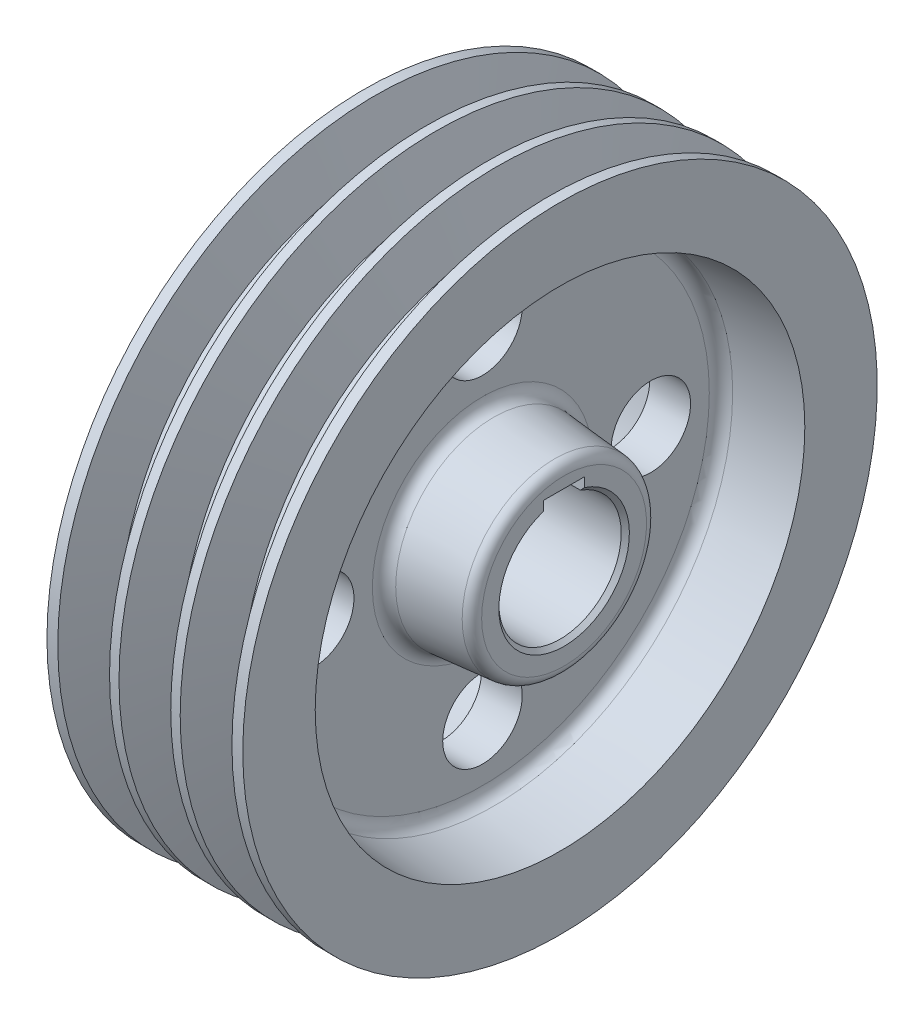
ISO-10303-21;
HEADER;
FILE_DESCRIPTION(('STEP AP214'),'2;1');
FILE_NAME('part.step','',(''),(''),'','','');
FILE_SCHEMA(('AUTOMOTIVE_DESIGN { 1 0 10303 214 1 1 1 1 }'));
ENDSEC;
DATA;
#1=APPLICATION_CONTEXT('core data for automotive mechanical design processes');
#2=APPLICATION_PROTOCOL_DEFINITION('international standard','automotive_design',2000,#1);
#3=PRODUCT_CONTEXT('',#1,'mechanical');
#4=PRODUCT('Part','Part','',(#3));
#5=PRODUCT_RELATED_PRODUCT_CATEGORY('part','',(#4));
#6=PRODUCT_DEFINITION_FORMATION('','',#4);
#7=PRODUCT_DEFINITION_CONTEXT('part definition',#1,'design');
#8=PRODUCT_DEFINITION('design','',#6,#7);
#9=PRODUCT_DEFINITION_SHAPE('','',#8);
#10=(LENGTH_UNIT() NAMED_UNIT(*) SI_UNIT(.MILLI.,.METRE.));
#11=(NAMED_UNIT(*) PLANE_ANGLE_UNIT() SI_UNIT($,.RADIAN.));
#12=(NAMED_UNIT(*) SI_UNIT($,.STERADIAN.) SOLID_ANGLE_UNIT());
#13=UNCERTAINTY_MEASURE_WITH_UNIT(LENGTH_MEASURE(1.E-05),#10,'distance_accuracy_value','');
#14=(GEOMETRIC_REPRESENTATION_CONTEXT(3) GLOBAL_UNCERTAINTY_ASSIGNED_CONTEXT((#13)) GLOBAL_UNIT_ASSIGNED_CONTEXT((#10,
#11,#12)) REPRESENTATION_CONTEXT('',''));
#15=CARTESIAN_POINT('',(0.,0.,0.));
#16=DIRECTION('',(0.,0.,1.));
#17=DIRECTION('',(1.,0.,0.));
#18=AXIS2_PLACEMENT_3D('',#15,#16,#17);
#19=CARTESIAN_POINT('',(19.,24.2497732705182,0.));
#20=DIRECTION('',(1.,0.,0.));
#21=DIRECTION('',(0.,0.,-1.));
#22=AXIS2_PLACEMENT_3D('',#19,#20,#21);
#23=PLANE('',#22);
#24=CARTESIAN_POINT('',(19.,-41.25,2.88047210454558E-13));
#25=DIRECTION('',(1.,0.,0.));
#26=DIRECTION('',(0.,0.,-1.));
#27=AXIS2_PLACEMENT_3D('',#24,#25,#26);
#28=CIRCLE('',#27,9.75000000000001);
#29=CARTESIAN_POINT('',(19.,-41.25,-9.74999999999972));
#30=VERTEX_POINT('',#29);
#31=EDGE_CURVE('E330',#30,#30,#28,.F.);
#32=ORIENTED_EDGE('',*,*,#31,.F.);
#33=EDGE_LOOP('',(#32));
#34=FACE_BOUND('',#33,.T.);
#35=CARTESIAN_POINT('',(19.,41.25,0.));
#36=DIRECTION('',(1.,0.,0.));
#37=DIRECTION('',(0.,0.,-1.));
#38=AXIS2_PLACEMENT_3D('',#35,#36,#37);
#39=CIRCLE('',#38,9.75000000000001);
#40=CARTESIAN_POINT('',(19.,41.25,-9.75000000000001));
#41=VERTEX_POINT('',#40);
#42=EDGE_CURVE('E116',#41,#41,#39,.F.);
#43=ORIENTED_EDGE('',*,*,#42,.F.);
#44=EDGE_LOOP('',(#43));
#45=FACE_BOUND('',#44,.T.);
#46=CARTESIAN_POINT('',(19.,0.,0.));
#47=DIRECTION('',(1.,0.,0.));
#48=DIRECTION('',(0.,0.,-1.));
#49=AXIS2_PLACEMENT_3D('',#46,#47,#48);
#50=CIRCLE('',#49,26.9987667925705);
#51=CARTESIAN_POINT('',(19.,0.,-26.9987667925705));
#52=VERTEX_POINT('',#51);
#53=EDGE_CURVE('E296',#52,#52,#50,.T.);
#54=ORIENTED_EDGE('',*,*,#53,.T.);
#55=EDGE_LOOP('',(#54));
#56=FACE_BOUND('',#55,.T.);
#57=CARTESIAN_POINT('',(19.,0.,0.));
#58=DIRECTION('',(1.,0.,0.));
#59=DIRECTION('',(0.,0.,-1.));
#60=AXIS2_PLACEMENT_3D('',#57,#58,#59);
#61=CIRCLE('',#60,55.5887218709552);
#62=CARTESIAN_POINT('',(19.,0.,-55.5887218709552));
#63=VERTEX_POINT('',#62);
#64=EDGE_CURVE('E292',#63,#63,#61,.F.);
#65=ORIENTED_EDGE('',*,*,#64,.T.);
#66=EDGE_LOOP('',(#65));
#67=FACE_BOUND('',#66,.T.);
#68=CARTESIAN_POINT('',(19.,-1.44023605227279E-13,-41.25));
#69=DIRECTION('',(1.,0.,0.));
#70=DIRECTION('',(0.,0.,-1.));
#71=AXIS2_PLACEMENT_3D('',#68,#69,#70);
#72=CIRCLE('',#71,9.75000000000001);
#73=CARTESIAN_POINT('',(19.,-1.44023605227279E-13,-51.));
#74=VERTEX_POINT('',#73);
#75=EDGE_CURVE('E327',#74,#74,#72,.F.);
#76=ORIENTED_EDGE('',*,*,#75,.F.);
#77=EDGE_LOOP('',(#76));
#78=FACE_BOUND('',#77,.T.);
#79=CARTESIAN_POINT('',(19.,4.32070815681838E-13,41.25));
#80=DIRECTION('',(1.,0.,0.));
#81=DIRECTION('',(0.,0.,-1.));
#82=AXIS2_PLACEMENT_3D('',#79,#80,#81);
#83=CIRCLE('',#82,9.75000000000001);
#84=CARTESIAN_POINT('',(19.,4.32070815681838E-13,31.5));
#85=VERTEX_POINT('',#84);
#86=EDGE_CURVE('E333',#85,#85,#83,.F.);
#87=ORIENTED_EDGE('',*,*,#86,.F.);
#88=EDGE_LOOP('',(#87));
#89=FACE_BOUND('',#88,.T.);
#90=ADVANCED_FACE('F33',(#34,#45,#56,#67,#78,#89),#23,.F.);
#91=CARTESIAN_POINT('',(29.,58.3377153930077,0.));
#92=DIRECTION('',(-1.,0.,0.));
#93=DIRECTION('',(0.,0.,1.));
#94=AXIS2_PLACEMENT_3D('',#91,#92,#93);
#95=PLANE('',#94);
#96=CARTESIAN_POINT('',(29.,-41.25,2.88047210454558E-13));
#97=DIRECTION('',(-1.,0.,0.));
#98=DIRECTION('',(0.,0.,1.));
#99=AXIS2_PLACEMENT_3D('',#96,#97,#98);
#100=CIRCLE('',#99,9.75000000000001);
#101=CARTESIAN_POINT('',(29.,-41.25,9.75000000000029));
#102=VERTEX_POINT('',#101);
#103=EDGE_CURVE('E331',#102,#102,#100,.F.);
#104=ORIENTED_EDGE('',*,*,#103,.F.);
#105=EDGE_LOOP('',(#104));
#106=FACE_BOUND('',#105,.T.);
#107=CARTESIAN_POINT('',(29.,41.25,0.));
#108=DIRECTION('',(-1.,0.,0.));
#109=DIRECTION('',(0.,0.,1.));
#110=AXIS2_PLACEMENT_3D('',#107,#108,#109);
#111=CIRCLE('',#110,9.75000000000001);
#112=CARTESIAN_POINT('',(29.,41.25,9.75000000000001));
#113=VERTEX_POINT('',#112);
#114=EDGE_CURVE('E324',#113,#113,#111,.F.);
#115=ORIENTED_EDGE('',*,*,#114,.F.);
#116=EDGE_LOOP('',(#115));
#117=FACE_BOUND('',#116,.T.);
#118=CARTESIAN_POINT('',(29.,0.,0.));
#119=DIRECTION('',(-1.,0.,0.));
#120=DIRECTION('',(0.,0.,1.));
#121=AXIS2_PLACEMENT_3D('',#118,#119,#120);
#122=CIRCLE('',#121,26.9987667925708);
#123=CARTESIAN_POINT('',(29.,0.,26.9987667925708));
#124=VERTEX_POINT('',#123);
#125=EDGE_CURVE('E307',#124,#124,#122,.T.);
#126=ORIENTED_EDGE('',*,*,#125,.T.);
#127=EDGE_LOOP('',(#126));
#128=FACE_BOUND('',#127,.T.);
#129=CARTESIAN_POINT('',(29.,0.,0.));
#130=DIRECTION('',(-1.,0.,0.));
#131=DIRECTION('',(0.,0.,1.));
#132=AXIS2_PLACEMENT_3D('',#129,#130,#131);
#133=CIRCLE('',#132,55.5887218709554);
#134=CARTESIAN_POINT('',(29.,0.,55.5887218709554));
#135=VERTEX_POINT('',#134);
#136=EDGE_CURVE('E304',#135,#135,#133,.F.);
#137=ORIENTED_EDGE('',*,*,#136,.T.);
#138=EDGE_LOOP('',(#137));
#139=FACE_BOUND('',#138,.T.);
#140=CARTESIAN_POINT('',(29.,-1.44023605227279E-13,-41.25));
#141=DIRECTION('',(-1.,0.,0.));
#142=DIRECTION('',(0.,0.,1.));
#143=AXIS2_PLACEMENT_3D('',#140,#141,#142);
#144=CIRCLE('',#143,9.75000000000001);
#145=CARTESIAN_POINT('',(29.,-1.44023605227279E-13,-31.5));
#146=VERTEX_POINT('',#145);
#147=EDGE_CURVE('E328',#146,#146,#144,.F.);
#148=ORIENTED_EDGE('',*,*,#147,.F.);
#149=EDGE_LOOP('',(#148));
#150=FACE_BOUND('',#149,.T.);
#151=CARTESIAN_POINT('',(29.,4.32070815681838E-13,41.25));
#152=DIRECTION('',(-1.,0.,0.));
#153=DIRECTION('',(0.,0.,1.));
#154=AXIS2_PLACEMENT_3D('',#151,#152,#153);
#155=CIRCLE('',#154,9.75000000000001);
#156=CARTESIAN_POINT('',(29.,4.32070815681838E-13,51.));
#157=VERTEX_POINT('',#156);
#158=EDGE_CURVE('E37',#157,#157,#155,.F.);
#159=ORIENTED_EDGE('',*,*,#158,.F.);
#160=EDGE_LOOP('',(#159));
#161=FACE_BOUND('',#160,.T.);
#162=ADVANCED_FACE('F193',(#106,#117,#128,#139,#150,#161),#95,.F.);
#163=CARTESIAN_POINT('',(0.,0.,0.));
#164=DIRECTION('',(-1.,0.,0.));
#165=DIRECTION('',(0.,0.,1.));
#166=AXIS2_PLACEMENT_3D('',#163,#164,#165);
#167=CYLINDRICAL_SURFACE('',#166,77.75);
#168=CARTESIAN_POINT('',(48.,0.,0.));
#169=DIRECTION('',(-1.,0.,0.));
#170=DIRECTION('',(0.,0.,1.));
#171=AXIS2_PLACEMENT_3D('',#168,#169,#170);
#172=CIRCLE('',#171,77.75);
#173=CARTESIAN_POINT('',(48.,0.,77.75));
#174=VERTEX_POINT('',#173);
#175=EDGE_CURVE('E245',#174,#174,#172,.T.);
#176=ORIENTED_EDGE('',*,*,#175,.T.);
#177=EDGE_LOOP('',(#176));
#178=FACE_BOUND('',#177,.T.);
#179=CARTESIAN_POINT('',(45.3407593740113,0.,0.));
#180=DIRECTION('',(-1.,0.,0.));
#181=DIRECTION('',(0.,0.,1.));
#182=AXIS2_PLACEMENT_3D('',#179,#180,#181);
#183=CIRCLE('',#182,77.75);
#184=CARTESIAN_POINT('',(45.3407593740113,0.,77.75));
#185=VERTEX_POINT('',#184);
#186=EDGE_CURVE('E278',#185,#185,#183,.T.);
#187=ORIENTED_EDGE('',*,*,#186,.F.);
#188=EDGE_LOOP('',(#187));
#189=FACE_BOUND('',#188,.T.);
#190=ADVANCED_FACE('F199',(#178,#189),#167,.T.);
#191=CARTESIAN_POINT('',(30.3407593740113,0.,0.));
#192=DIRECTION('',(-1.,0.,0.));
#193=DIRECTION('',(0.,0.,1.));
#194=AXIS2_PLACEMENT_3D('',#191,#192,#193);
#195=CIRCLE('',#194,77.75);
#196=CARTESIAN_POINT('',(30.3407593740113,0.,77.75));
#197=VERTEX_POINT('',#196);
#198=EDGE_CURVE('E266',#197,#197,#195,.T.);
#199=ORIENTED_EDGE('',*,*,#198,.F.);
#200=EDGE_LOOP('',(#199));
#201=FACE_BOUND('',#200,.T.);
#202=CARTESIAN_POINT('',(32.6592406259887,0.,0.));
#203=DIRECTION('',(-1.,0.,0.));
#204=DIRECTION('',(0.,0.,1.));
#205=AXIS2_PLACEMENT_3D('',#202,#203,#204);
#206=CIRCLE('',#205,77.75);
#207=CARTESIAN_POINT('',(32.6592406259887,0.,77.75));
#208=VERTEX_POINT('',#207);
#209=EDGE_CURVE('E281',#208,#208,#206,.T.);
#210=ORIENTED_EDGE('',*,*,#209,.T.);
#211=EDGE_LOOP('',(#210));
#212=FACE_BOUND('',#211,.T.);
#213=ADVANCED_FACE('F604',(#201,#212),#167,.T.);
#214=CARTESIAN_POINT('',(15.3407593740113,0.,0.));
#215=DIRECTION('',(-1.,0.,0.));
#216=DIRECTION('',(0.,0.,1.));
#217=AXIS2_PLACEMENT_3D('',#214,#215,#216);
#218=CIRCLE('',#217,77.75);
#219=CARTESIAN_POINT('',(15.3407593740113,0.,77.75));
#220=VERTEX_POINT('',#219);
#221=EDGE_CURVE('E254',#220,#220,#218,.T.);
#222=ORIENTED_EDGE('',*,*,#221,.F.);
#223=EDGE_LOOP('',(#222));
#224=FACE_BOUND('',#223,.T.);
#225=CARTESIAN_POINT('',(17.6592406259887,0.,0.));
#226=DIRECTION('',(-1.,0.,0.));
#227=DIRECTION('',(0.,0.,1.));
#228=AXIS2_PLACEMENT_3D('',#225,#226,#227);
#229=CIRCLE('',#228,77.75);
#230=CARTESIAN_POINT('',(17.6592406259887,0.,77.75));
#231=VERTEX_POINT('',#230);
#232=EDGE_CURVE('E269',#231,#231,#229,.T.);
#233=ORIENTED_EDGE('',*,*,#232,.T.);
#234=EDGE_LOOP('',(#233));
#235=FACE_BOUND('',#234,.T.);
#236=ADVANCED_FACE('F222',(#224,#235),#167,.T.);
#237=CARTESIAN_POINT('',(0.,0.,0.));
#238=DIRECTION('',(-1.,0.,0.));
#239=DIRECTION('',(0.,0.,1.));
#240=AXIS2_PLACEMENT_3D('',#237,#238,#239);
#241=CIRCLE('',#240,77.75);
#242=CARTESIAN_POINT('',(0.,0.,77.75));
#243=VERTEX_POINT('',#242);
#244=EDGE_CURVE('E242',#243,#243,#241,.T.);
#245=ORIENTED_EDGE('',*,*,#244,.F.);
#246=EDGE_LOOP('',(#245));
#247=FACE_BOUND('',#246,.T.);
#248=CARTESIAN_POINT('',(2.65924062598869,0.,0.));
#249=DIRECTION('',(-1.,0.,0.));
#250=DIRECTION('',(0.,0.,1.));
#251=AXIS2_PLACEMENT_3D('',#248,#249,#250);
#252=CIRCLE('',#251,77.75);
#253=CARTESIAN_POINT('',(2.65924062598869,0.,77.75));
#254=VERTEX_POINT('',#253);
#255=EDGE_CURVE('E257',#254,#254,#252,.T.);
#256=ORIENTED_EDGE('',*,*,#255,.T.);
#257=EDGE_LOOP('',(#256));
#258=FACE_BOUND('',#257,.T.);
#259=ADVANCED_FACE('F217',(#247,#258),#167,.T.);
#260=CARTESIAN_POINT('',(0.,0.,0.));
#261=DIRECTION('',(-1.,0.,0.));
#262=DIRECTION('',(0.,0.,1.));
#263=AXIS2_PLACEMENT_3D('',#260,#261,#262);
#264=CYLINDRICAL_SURFACE('',#263,15.);
#265=CARTESIAN_POINT('',(0.,0.,0.));
#266=DIRECTION('',(1.,0.,0.));
#267=DIRECTION('',(0.,0.,-1.));
#268=AXIS2_PLACEMENT_3D('',#265,#266,#267);
#269=CIRCLE('',#268,15.);
#270=CARTESIAN_POINT('',(0.,14.1421356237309,-5.));
#271=VERTEX_POINT('',#270);
#272=CARTESIAN_POINT('',(0.,14.1421356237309,5.));
#273=VERTEX_POINT('',#272);
#274=EDGE_CURVE('E228',#271,#273,#269,.F.);
#275=ORIENTED_EDGE('',*,*,#274,.T.);
#276=DIRECTION('',(-1.,0.,0.));
#277=VECTOR('',#276,1.);
#278=CARTESIAN_POINT('',(49.,14.1421356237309,5.));
#279=LINE('',#278,#277);
#280=CARTESIAN_POINT('',(48.,14.1421356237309,5.));
#281=VERTEX_POINT('',#280);
#282=EDGE_CURVE('E95',#281,#273,#279,.T.);
#283=ORIENTED_EDGE('',*,*,#282,.F.);
#284=CARTESIAN_POINT('',(48.,0.,0.));
#285=DIRECTION('',(-1.,0.,0.));
#286=DIRECTION('',(0.,0.,1.));
#287=AXIS2_PLACEMENT_3D('',#284,#285,#286);
#288=CIRCLE('',#287,15.);
#289=CARTESIAN_POINT('',(48.,14.1421356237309,-5.));
#290=VERTEX_POINT('',#289);
#291=EDGE_CURVE('E234',#281,#290,#288,.F.);
#292=ORIENTED_EDGE('',*,*,#291,.T.);
#293=DIRECTION('',(-1.,0.,0.));
#294=VECTOR('',#293,1.);
#295=CARTESIAN_POINT('',(49.,14.1421356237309,-5.));
#296=LINE('',#295,#294);
#297=EDGE_CURVE('E103',#290,#271,#296,.T.);
#298=ORIENTED_EDGE('',*,*,#297,.T.);
#299=EDGE_LOOP('',(#275,#283,#292,#298));
#300=FACE_BOUND('',#299,.T.);
#301=ADVANCED_FACE('F214',(#300),#264,.F.);
#302=CARTESIAN_POINT('',(-1.,15.,0.));
#303=DIRECTION('',(1.,0.,0.));
#304=DIRECTION('',(0.,0.,-1.));
#305=AXIS2_PLACEMENT_3D('',#302,#303,#304);
#306=PLANE('',#305);
#307=CARTESIAN_POINT('',(-1.,0.,0.));
#308=DIRECTION('',(1.,0.,0.));
#309=DIRECTION('',(0.,0.,-1.));
#310=AXIS2_PLACEMENT_3D('',#307,#308,#309);
#311=CIRCLE('',#310,20.2091720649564);
#312=CARTESIAN_POINT('',(-1.,0.,-20.2091720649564));
#313=VERTEX_POINT('',#312);
#314=EDGE_CURVE('E42',#313,#313,#311,.F.);
#315=ORIENTED_EDGE('',*,*,#314,.T.);
#316=EDGE_LOOP('',(#315));
#317=FACE_BOUND('',#316,.T.);
#318=CARTESIAN_POINT('',(-1.,0.,0.));
#319=DIRECTION('',(1.,0.,0.));
#320=DIRECTION('',(0.,0.,-1.));
#321=AXIS2_PLACEMENT_3D('',#318,#319,#320);
#322=CIRCLE('',#321,16.);
#323=CARTESIAN_POINT('',(-1.,15.1986841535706,5.));
#324=VERTEX_POINT('',#323);
#325=CARTESIAN_POINT('',(-1.,15.1986841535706,-5.));
#326=VERTEX_POINT('',#325);
#327=EDGE_CURVE('E233',#324,#326,#322,.T.);
#328=ORIENTED_EDGE('',*,*,#327,.T.);
#329=DIRECTION('',(0.,-1.,0.));
#330=VECTOR('',#329,1.);
#331=CARTESIAN_POINT('',(-1.,14.1421356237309,-5.));
#332=LINE('',#331,#330);
#333=CARTESIAN_POINT('',(-1.,17.5,-5.));
#334=VERTEX_POINT('',#333);
#335=EDGE_CURVE('E58',#334,#326,#332,.T.);
#336=ORIENTED_EDGE('',*,*,#335,.F.);
#337=DIRECTION('',(0.,0.,-1.));
#338=VECTOR('',#337,1.);
#339=CARTESIAN_POINT('',(-1.,17.5,-5.));
#340=LINE('',#339,#338);
#341=CARTESIAN_POINT('',(-1.,17.5,5.));
#342=VERTEX_POINT('',#341);
#343=EDGE_CURVE('E111',#342,#334,#340,.T.);
#344=ORIENTED_EDGE('',*,*,#343,.F.);
#345=DIRECTION('',(0.,1.,0.));
#346=VECTOR('',#345,1.);
#347=CARTESIAN_POINT('',(-1.,14.1421356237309,5.));
#348=LINE('',#347,#346);
#349=EDGE_CURVE('E90',#324,#342,#348,.T.);
#350=ORIENTED_EDGE('',*,*,#349,.F.);
#351=EDGE_LOOP('',(#328,#336,#344,#350));
#352=FACE_BOUND('',#351,.T.);
#353=ADVANCED_FACE('F211',(#317,#352),#306,.F.);
#354=CARTESIAN_POINT('',(19.,0.,0.));
#355=DIRECTION('',(1.,0.,0.));
#356=DIRECTION('',(0.,0.,-1.));
#357=AXIS2_PLACEMENT_3D('',#354,#355,#356);
#358=CONICAL_SURFACE('',#357,24.2497732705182,0.0872664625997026);
#359=CARTESIAN_POINT('',(1.28211064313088,0.,0.));
#360=DIRECTION('',(-1.,0.,0.));
#361=DIRECTION('',(0.,0.,1.));
#362=AXIS2_PLACEMENT_3D('',#359,#360,#361);
#363=CIRCLE('',#362,22.6996588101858);
#364=CARTESIAN_POINT('',(1.28211064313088,0.,22.6996588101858));
#365=VERTEX_POINT('',#364);
#366=EDGE_CURVE('E11',#365,#365,#363,.F.);
#367=ORIENTED_EDGE('',*,*,#366,.T.);
#368=EDGE_LOOP('',(#367));
#369=FACE_BOUND('',#368,.T.);
#370=CARTESIAN_POINT('',(16.2614672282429,0.,0.));
#371=DIRECTION('',(1.,0.,0.));
#372=DIRECTION('',(0.,0.,-1.));
#373=AXIS2_PLACEMENT_3D('',#370,#371,#372);
#374=CIRCLE('',#373,24.0101826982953);
#375=CARTESIAN_POINT('',(16.2614672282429,0.,-24.0101826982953));
#376=VERTEX_POINT('',#375);
#377=EDGE_CURVE('E290',#376,#376,#374,.F.);
#378=ORIENTED_EDGE('',*,*,#377,.T.);
#379=EDGE_LOOP('',(#378));
#380=FACE_BOUND('',#379,.T.);
#381=ADVANCED_FACE('F208',(#369,#380),#358,.T.);
#382=CARTESIAN_POINT('',(0.,0.,0.));
#383=DIRECTION('',(-1.,0.,0.));
#384=DIRECTION('',(0.,0.,1.));
#385=AXIS2_PLACEMENT_3D('',#382,#383,#384);
#386=CONICAL_SURFACE('',#385,60.,0.0872664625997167);
#387=CARTESIAN_POINT('',(16.261467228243,0.,0.));
#388=DIRECTION('',(-1.,0.,0.));
#389=DIRECTION('',(0.,0.,1.));
#390=AXIS2_PLACEMENT_3D('',#387,#388,#389);
#391=CIRCLE('',#390,58.5773059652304);
#392=CARTESIAN_POINT('',(16.261467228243,0.,58.5773059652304));
#393=VERTEX_POINT('',#392);
#394=EDGE_CURVE('E301',#393,#393,#391,.F.);
#395=ORIENTED_EDGE('',*,*,#394,.T.);
#396=EDGE_LOOP('',(#395));
#397=FACE_BOUND('',#396,.T.);
#398=CARTESIAN_POINT('',(0.,0.,0.));
#399=DIRECTION('',(-1.,0.,0.));
#400=DIRECTION('',(0.,0.,1.));
#401=AXIS2_PLACEMENT_3D('',#398,#399,#400);
#402=CIRCLE('',#401,60.);
#403=CARTESIAN_POINT('',(0.,0.,60.));
#404=VERTEX_POINT('',#403);
#405=EDGE_CURVE('E237',#404,#404,#402,.T.);
#406=ORIENTED_EDGE('',*,*,#405,.T.);
#407=EDGE_LOOP('',(#406));
#408=FACE_BOUND('',#407,.T.);
#409=ADVANCED_FACE('F206',(#397,#408),#386,.F.);
#410=CARTESIAN_POINT('',(0.,60.,0.));
#411=DIRECTION('',(1.,0.,0.));
#412=DIRECTION('',(0.,0.,-1.));
#413=AXIS2_PLACEMENT_3D('',#410,#411,#412);
#414=PLANE('',#413);
#415=ORIENTED_EDGE('',*,*,#405,.F.);
#416=EDGE_LOOP('',(#415));
#417=FACE_BOUND('',#416,.T.);
#418=ORIENTED_EDGE('',*,*,#244,.T.);
#419=EDGE_LOOP('',(#418));
#420=FACE_BOUND('',#419,.T.);
#421=ADVANCED_FACE('F495',(#417,#420),#414,.F.);
#422=CARTESIAN_POINT('',(48.,77.75,0.));
#423=DIRECTION('',(-1.,0.,0.));
#424=DIRECTION('',(0.,0.,1.));
#425=AXIS2_PLACEMENT_3D('',#422,#423,#424);
#426=PLANE('',#425);
#427=ORIENTED_EDGE('',*,*,#175,.F.);
#428=EDGE_LOOP('',(#427));
#429=FACE_BOUND('',#428,.T.);
#430=CARTESIAN_POINT('',(48.,0.,0.));
#431=DIRECTION('',(-1.,0.,0.));
#432=DIRECTION('',(0.,0.,1.));
#433=AXIS2_PLACEMENT_3D('',#430,#431,#432);
#434=CIRCLE('',#433,60.);
#435=CARTESIAN_POINT('',(48.,0.,60.));
#436=VERTEX_POINT('',#435);
#437=EDGE_CURVE('E248',#436,#436,#434,.T.);
#438=ORIENTED_EDGE('',*,*,#437,.T.);
#439=EDGE_LOOP('',(#438));
#440=FACE_BOUND('',#439,.T.);
#441=ADVANCED_FACE('F485',(#429,#440),#426,.F.);
#442=CARTESIAN_POINT('',(29.,0.,0.));
#443=DIRECTION('',(1.,0.,0.));
#444=DIRECTION('',(0.,0.,-1.));
#445=AXIS2_PLACEMENT_3D('',#442,#443,#444);
#446=CONICAL_SURFACE('',#445,58.3377153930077,0.0872664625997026);
#447=CARTESIAN_POINT('',(31.7385327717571,0.,0.));
#448=DIRECTION('',(1.,0.,0.));
#449=DIRECTION('',(0.,0.,-1.));
#450=AXIS2_PLACEMENT_3D('',#447,#448,#449);
#451=CIRCLE('',#450,58.5773059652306);
#452=CARTESIAN_POINT('',(31.7385327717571,0.,-58.5773059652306));
#453=VERTEX_POINT('',#452);
#454=EDGE_CURVE('E313',#453,#453,#451,.F.);
#455=ORIENTED_EDGE('',*,*,#454,.T.);
#456=EDGE_LOOP('',(#455));
#457=FACE_BOUND('',#456,.T.);
#458=ORIENTED_EDGE('',*,*,#437,.F.);
#459=EDGE_LOOP('',(#458));
#460=FACE_BOUND('',#459,.T.);
#461=ADVANCED_FACE('F436',(#457,#460),#446,.F.);
#462=CARTESIAN_POINT('',(49.,0.,0.));
#463=DIRECTION('',(-1.,0.,0.));
#464=DIRECTION('',(0.,0.,1.));
#465=AXIS2_PLACEMENT_3D('',#462,#463,#464);
#466=CONICAL_SURFACE('',#465,22.5,0.0872664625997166);
#467=CARTESIAN_POINT('',(46.7178893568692,0.,0.));
#468=DIRECTION('',(1.,0.,0.));
#469=DIRECTION('',(0.,0.,-1.));
#470=AXIS2_PLACEMENT_3D('',#467,#468,#469);
#471=CIRCLE('',#470,22.6996588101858);
#472=CARTESIAN_POINT('',(46.7178893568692,0.,-22.6996588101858));
#473=VERTEX_POINT('',#472);
#474=EDGE_CURVE('E316',#473,#473,#471,.F.);
#475=ORIENTED_EDGE('',*,*,#474,.T.);
#476=EDGE_LOOP('',(#475));
#477=FACE_BOUND('',#476,.T.);
#478=CARTESIAN_POINT('',(31.738532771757,0.,0.));
#479=DIRECTION('',(-1.,0.,0.));
#480=DIRECTION('',(0.,0.,1.));
#481=AXIS2_PLACEMENT_3D('',#478,#479,#480);
#482=CIRCLE('',#481,24.0101826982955);
#483=CARTESIAN_POINT('',(31.738532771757,0.,24.0101826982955));
#484=VERTEX_POINT('',#483);
#485=EDGE_CURVE('E310',#484,#484,#482,.F.);
#486=ORIENTED_EDGE('',*,*,#485,.T.);
#487=EDGE_LOOP('',(#486));
#488=FACE_BOUND('',#487,.T.);
#489=ADVANCED_FACE('F424',(#477,#488),#466,.T.);
#490=CARTESIAN_POINT('',(49.,22.5,0.));
#491=DIRECTION('',(-1.,0.,0.));
#492=DIRECTION('',(0.,0.,1.));
#493=AXIS2_PLACEMENT_3D('',#490,#491,#492);
#494=PLANE('',#493);
#495=CARTESIAN_POINT('',(49.,0.,0.));
#496=DIRECTION('',(-1.,0.,0.));
#497=DIRECTION('',(0.,0.,1.));
#498=AXIS2_PLACEMENT_3D('',#495,#496,#497);
#499=CIRCLE('',#498,20.2091720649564);
#500=CARTESIAN_POINT('',(49.,0.,20.2091720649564));
#501=VERTEX_POINT('',#500);
#502=EDGE_CURVE('E319',#501,#501,#499,.F.);
#503=ORIENTED_EDGE('',*,*,#502,.T.);
#504=EDGE_LOOP('',(#503));
#505=FACE_BOUND('',#504,.T.);
#506=DIRECTION('',(0.,0.,-1.));
#507=VECTOR('',#506,1.);
#508=CARTESIAN_POINT('',(49.,17.5,-5.));
#509=LINE('',#508,#507);
#510=CARTESIAN_POINT('',(49.,17.5,5.));
#511=VERTEX_POINT('',#510);
#512=CARTESIAN_POINT('',(49.,17.5,-5.));
#513=VERTEX_POINT('',#512);
#514=EDGE_CURVE('E98',#511,#513,#509,.T.);
#515=ORIENTED_EDGE('',*,*,#514,.T.);
#516=DIRECTION('',(0.,-1.,0.));
#517=VECTOR('',#516,1.);
#518=CARTESIAN_POINT('',(49.,14.1421356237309,-5.));
#519=LINE('',#518,#517);
#520=CARTESIAN_POINT('',(49.,15.1986841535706,-5.));
#521=VERTEX_POINT('',#520);
#522=EDGE_CURVE('E109',#513,#521,#519,.T.);
#523=ORIENTED_EDGE('',*,*,#522,.T.);
#524=CARTESIAN_POINT('',(49.,0.,0.));
#525=DIRECTION('',(-1.,0.,0.));
#526=DIRECTION('',(0.,0.,1.));
#527=AXIS2_PLACEMENT_3D('',#524,#525,#526);
#528=CIRCLE('',#527,16.);
#529=CARTESIAN_POINT('',(49.,15.1986841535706,5.));
#530=VERTEX_POINT('',#529);
#531=EDGE_CURVE('E108',#521,#530,#528,.T.);
#532=ORIENTED_EDGE('',*,*,#531,.T.);
#533=DIRECTION('',(0.,1.,0.));
#534=VECTOR('',#533,1.);
#535=CARTESIAN_POINT('',(49.,14.1421356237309,5.));
#536=LINE('',#535,#534);
#537=EDGE_CURVE('E50',#530,#511,#536,.T.);
#538=ORIENTED_EDGE('',*,*,#537,.T.);
#539=EDGE_LOOP('',(#515,#523,#532,#538));
#540=FACE_BOUND('',#539,.T.);
#541=ADVANCED_FACE('F106',(#505,#540),#494,.F.);
#542=CARTESIAN_POINT('',(0.,0.,0.));
#543=DIRECTION('',(-1.,0.,0.));
#544=DIRECTION('',(0.,0.,1.));
#545=AXIS2_PLACEMENT_3D('',#542,#543,#544);
#546=CYLINDRICAL_SURFACE('',#545,66.3);
#547=CARTESIAN_POINT('',(11.8401430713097,0.,0.));
#548=DIRECTION('',(-1.,0.,0.));
#549=DIRECTION('',(0.,0.,1.));
#550=AXIS2_PLACEMENT_3D('',#547,#548,#549);
#551=CIRCLE('',#550,66.3);
#552=CARTESIAN_POINT('',(11.8401430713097,0.,66.3));
#553=VERTEX_POINT('',#552);
#554=EDGE_CURVE('E251',#553,#553,#551,.T.);
#555=ORIENTED_EDGE('',*,*,#554,.T.);
#556=EDGE_LOOP('',(#555));
#557=FACE_BOUND('',#556,.T.);
#558=CARTESIAN_POINT('',(6.15985692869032,0.,0.));
#559=DIRECTION('',(-1.,0.,0.));
#560=DIRECTION('',(0.,0.,1.));
#561=AXIS2_PLACEMENT_3D('',#558,#559,#560);
#562=CIRCLE('',#561,66.3);
#563=CARTESIAN_POINT('',(6.15985692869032,0.,66.3));
#564=VERTEX_POINT('',#563);
#565=EDGE_CURVE('E260',#564,#564,#562,.T.);
#566=ORIENTED_EDGE('',*,*,#565,.F.);
#567=EDGE_LOOP('',(#566));
#568=FACE_BOUND('',#567,.T.);
#569=ADVANCED_FACE('F423',(#557,#568),#546,.T.);
#570=CARTESIAN_POINT('',(11.8401430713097,0.,0.));
#571=DIRECTION('',(1.,0.,0.));
#572=DIRECTION('',(0.,0.,-1.));
#573=AXIS2_PLACEMENT_3D('',#570,#571,#572);
#574=CONICAL_SURFACE('',#573,66.3,1.27409035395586);
#575=ORIENTED_EDGE('',*,*,#221,.T.);
#576=EDGE_LOOP('',(#575));
#577=FACE_BOUND('',#576,.T.);
#578=ORIENTED_EDGE('',*,*,#554,.F.);
#579=EDGE_LOOP('',(#578));
#580=FACE_BOUND('',#579,.T.);
#581=ADVANCED_FACE('F626',(#577,#580),#574,.T.);
#582=CARTESIAN_POINT('',(2.65924062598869,0.,0.));
#583=DIRECTION('',(-1.,0.,0.));
#584=DIRECTION('',(0.,0.,1.));
#585=AXIS2_PLACEMENT_3D('',#582,#583,#584);
#586=CONICAL_SURFACE('',#585,77.75,1.27409035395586);
#587=ORIENTED_EDGE('',*,*,#565,.T.);
#588=EDGE_LOOP('',(#587));
#589=FACE_BOUND('',#588,.T.);
#590=ORIENTED_EDGE('',*,*,#255,.F.);
#591=EDGE_LOOP('',(#590));
#592=FACE_BOUND('',#591,.T.);
#593=ADVANCED_FACE('F592',(#589,#592),#586,.T.);
#594=CARTESIAN_POINT('',(15.,0.,0.));
#595=DIRECTION('',(-1.,0.,0.));
#596=DIRECTION('',(0.,0.,1.));
#597=AXIS2_PLACEMENT_3D('',#594,#595,#596);
#598=CYLINDRICAL_SURFACE('',#597,66.3);
#599=CARTESIAN_POINT('',(26.8401430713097,0.,0.));
#600=DIRECTION('',(-1.,0.,0.));
#601=DIRECTION('',(0.,0.,1.));
#602=AXIS2_PLACEMENT_3D('',#599,#600,#601);
#603=CIRCLE('',#602,66.3);
#604=CARTESIAN_POINT('',(26.8401430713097,0.,66.3));
#605=VERTEX_POINT('',#604);
#606=EDGE_CURVE('E263',#605,#605,#603,.T.);
#607=ORIENTED_EDGE('',*,*,#606,.T.);
#608=EDGE_LOOP('',(#607));
#609=FACE_BOUND('',#608,.T.);
#610=CARTESIAN_POINT('',(21.1598569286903,0.,0.));
#611=DIRECTION('',(-1.,0.,0.));
#612=DIRECTION('',(0.,0.,1.));
#613=AXIS2_PLACEMENT_3D('',#610,#611,#612);
#614=CIRCLE('',#613,66.3);
#615=CARTESIAN_POINT('',(21.1598569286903,0.,66.3));
#616=VERTEX_POINT('',#615);
#617=EDGE_CURVE('E272',#616,#616,#614,.T.);
#618=ORIENTED_EDGE('',*,*,#617,.F.);
#619=EDGE_LOOP('',(#618));
#620=FACE_BOUND('',#619,.T.);
#621=ADVANCED_FACE('F582',(#609,#620),#598,.T.);
#622=CARTESIAN_POINT('',(26.8401430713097,0.,0.));
#623=DIRECTION('',(1.,0.,0.));
#624=DIRECTION('',(0.,0.,-1.));
#625=AXIS2_PLACEMENT_3D('',#622,#623,#624);
#626=CONICAL_SURFACE('',#625,66.3,1.27409035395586);
#627=ORIENTED_EDGE('',*,*,#198,.T.);
#628=EDGE_LOOP('',(#627));
#629=FACE_BOUND('',#628,.T.);
#630=ORIENTED_EDGE('',*,*,#606,.F.);
#631=EDGE_LOOP('',(#630));
#632=FACE_BOUND('',#631,.T.);
#633=ADVANCED_FACE('F572',(#629,#632),#626,.T.);
#634=CARTESIAN_POINT('',(17.6592406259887,0.,0.));
#635=DIRECTION('',(-1.,0.,0.));
#636=DIRECTION('',(0.,0.,1.));
#637=AXIS2_PLACEMENT_3D('',#634,#635,#636);
#638=CONICAL_SURFACE('',#637,77.75,1.27409035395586);
#639=ORIENTED_EDGE('',*,*,#617,.T.);
#640=EDGE_LOOP('',(#639));
#641=FACE_BOUND('',#640,.T.);
#642=ORIENTED_EDGE('',*,*,#232,.F.);
#643=EDGE_LOOP('',(#642));
#644=FACE_BOUND('',#643,.T.);
#645=ADVANCED_FACE('F562',(#641,#644),#638,.T.);
#646=CARTESIAN_POINT('',(30.,0.,0.));
#647=DIRECTION('',(-1.,0.,0.));
#648=DIRECTION('',(0.,0.,1.));
#649=AXIS2_PLACEMENT_3D('',#646,#647,#648);
#650=CYLINDRICAL_SURFACE('',#649,66.3);
#651=CARTESIAN_POINT('',(41.8401430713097,0.,0.));
#652=DIRECTION('',(-1.,0.,0.));
#653=DIRECTION('',(0.,0.,1.));
#654=AXIS2_PLACEMENT_3D('',#651,#652,#653);
#655=CIRCLE('',#654,66.3);
#656=CARTESIAN_POINT('',(41.8401430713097,0.,66.3));
#657=VERTEX_POINT('',#656);
#658=EDGE_CURVE('E275',#657,#657,#655,.T.);
#659=ORIENTED_EDGE('',*,*,#658,.T.);
#660=EDGE_LOOP('',(#659));
#661=FACE_BOUND('',#660,.T.);
#662=CARTESIAN_POINT('',(36.1598569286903,0.,0.));
#663=DIRECTION('',(-1.,0.,0.));
#664=DIRECTION('',(0.,0.,1.));
#665=AXIS2_PLACEMENT_3D('',#662,#663,#664);
#666=CIRCLE('',#665,66.3);
#667=CARTESIAN_POINT('',(36.1598569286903,0.,66.3));
#668=VERTEX_POINT('',#667);
#669=EDGE_CURVE('E283',#668,#668,#666,.T.);
#670=ORIENTED_EDGE('',*,*,#669,.F.);
#671=EDGE_LOOP('',(#670));
#672=FACE_BOUND('',#671,.T.);
#673=ADVANCED_FACE('F552',(#661,#672),#650,.T.);
#674=CARTESIAN_POINT('',(41.8401430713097,0.,0.));
#675=DIRECTION('',(1.,0.,0.));
#676=DIRECTION('',(0.,0.,-1.));
#677=AXIS2_PLACEMENT_3D('',#674,#675,#676);
#678=CONICAL_SURFACE('',#677,66.3,1.27409035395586);
#679=ORIENTED_EDGE('',*,*,#186,.T.);
#680=EDGE_LOOP('',(#679));
#681=FACE_BOUND('',#680,.T.);
#682=ORIENTED_EDGE('',*,*,#658,.F.);
#683=EDGE_LOOP('',(#682));
#684=FACE_BOUND('',#683,.T.);
#685=ADVANCED_FACE('F543',(#681,#684),#678,.T.);
#686=CARTESIAN_POINT('',(32.6592406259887,0.,0.));
#687=DIRECTION('',(-1.,0.,0.));
#688=DIRECTION('',(0.,0.,1.));
#689=AXIS2_PLACEMENT_3D('',#686,#687,#688);
#690=CONICAL_SURFACE('',#689,77.75,1.27409035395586);
#691=ORIENTED_EDGE('',*,*,#669,.T.);
#692=EDGE_LOOP('',(#691));
#693=FACE_BOUND('',#692,.T.);
#694=ORIENTED_EDGE('',*,*,#209,.F.);
#695=EDGE_LOOP('',(#694));
#696=FACE_BOUND('',#695,.T.);
#697=ADVANCED_FACE('F530',(#693,#696),#690,.T.);
#698=CARTESIAN_POINT('',(0.,0.,0.));
#699=DIRECTION('',(-1.,0.,0.));
#700=DIRECTION('',(0.,0.,1.));
#701=AXIS2_PLACEMENT_3D('',#698,#699,#700);
#702=CONICAL_SURFACE('',#701,15.,0.785398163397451);
#703=CARTESIAN_POINT('',(-3.58174559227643,17.8964038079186,-5.));
#704=CARTESIAN_POINT('',(-3.09997213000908,17.396118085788,-5.));
#705=CARTESIAN_POINT('',(-2.61889578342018,16.8951572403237,-5.));
#706=CARTESIAN_POINT('',(-1.65873232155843,15.8913611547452,-5.));
#707=CARTESIAN_POINT('',(-1.17964514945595,15.3885259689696,-5.));
#708=CARTESIAN_POINT('',(-0.224020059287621,14.3804207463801,-5.));
#709=CARTESIAN_POINT('',(0.252517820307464,13.8751506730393,-5.));
#710=CARTESIAN_POINT('',(0.964704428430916,13.1147774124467,-5.));
#711=CARTESIAN_POINT('',(1.20166665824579,12.8609046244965,-5.));
#712=CARTESIAN_POINT('',(1.67454529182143,12.3521847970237,-5.));
#713=CARTESIAN_POINT('',(1.91046169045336,12.0973377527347,-5.));
#714=CARTESIAN_POINT('',(2.14576896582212,11.8419278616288,-5.));
#715=B_SPLINE_CURVE_WITH_KNOTS('',3,(#703,#704,#705,#706,#707,#708,#709,#710,#711,#712,#713,
#714),.UNSPECIFIED.,.F.,.F.,(4,2,2,2,2,4),(0.,2.08363547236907,4.16721100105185,
6.25081788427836,7.29265135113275,8.33448992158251),.UNSPECIFIED.);
#716=EDGE_CURVE('E130',#326,#271,#715,.T.);
#717=ORIENTED_EDGE('',*,*,#716,.F.);
#718=ORIENTED_EDGE('',*,*,#327,.F.);
#719=CARTESIAN_POINT('',(2.14576896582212,11.8419278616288,5.));
#720=CARTESIAN_POINT('',(1.91046169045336,12.0973377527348,5.));
#721=CARTESIAN_POINT('',(1.67454529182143,12.3521847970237,5.));
#722=CARTESIAN_POINT('',(1.20166665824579,12.8609046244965,5.));
#723=CARTESIAN_POINT('',(0.964704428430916,13.1147774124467,5.));
#724=CARTESIAN_POINT('',(0.252517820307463,13.8751506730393,5.));
#725=CARTESIAN_POINT('',(-0.224020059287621,14.3804207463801,5.));
#726=CARTESIAN_POINT('',(-1.17964514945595,15.3885259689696,5.));
#727=CARTESIAN_POINT('',(-1.65873232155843,15.8913611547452,5.));
#728=CARTESIAN_POINT('',(-2.61889578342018,16.8951572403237,5.));
#729=CARTESIAN_POINT('',(-3.09997213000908,17.396118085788,5.));
#730=CARTESIAN_POINT('',(-3.58174559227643,17.8964038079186,5.));
#731=B_SPLINE_CURVE_WITH_KNOTS('',3,(#719,#720,#721,#722,#723,#724,#725,#726,#727,#728,#729,
#730),.UNSPECIFIED.,.F.,.F.,(4,2,2,2,2,4),(0.,1.04183857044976,2.08367203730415,
4.16727892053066,6.25085444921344,8.33448992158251),.UNSPECIFIED.);
#732=EDGE_CURVE('E119',#273,#324,#731,.T.);
#733=ORIENTED_EDGE('',*,*,#732,.F.);
#734=ORIENTED_EDGE('',*,*,#274,.F.);
#735=EDGE_LOOP('',(#717,#718,#733,#734));
#736=FACE_BOUND('',#735,.T.);
#737=ADVANCED_FACE('F136',(#736),#702,.F.);
#738=CARTESIAN_POINT('',(49.,0.,0.));
#739=DIRECTION('',(1.,0.,0.));
#740=DIRECTION('',(0.,0.,-1.));
#741=AXIS2_PLACEMENT_3D('',#738,#739,#740);
#742=CONICAL_SURFACE('',#741,16.,0.785398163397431);
#743=CARTESIAN_POINT('',(45.3935648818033,11.3402138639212,-5.));
#744=CARTESIAN_POINT('',(45.6280098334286,11.5964208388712,-5.));
#745=CARTESIAN_POINT('',(45.8631420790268,11.8519967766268,-5.));
#746=CARTESIAN_POINT('',(46.3345797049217,12.3620616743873,-5.));
#747=CARTESIAN_POINT('',(46.5708850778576,12.6165506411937,-5.));
#748=CARTESIAN_POINT('',(47.2812465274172,13.3786367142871,-5.));
#749=CARTESIAN_POINT('',(47.7567644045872,13.8848709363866,-5.));
#750=CARTESIAN_POINT('',(48.7106157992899,14.8946574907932,-5.));
#751=CARTESIAN_POINT('',(49.1889492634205,15.3982098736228,-5.));
#752=CARTESIAN_POINT('',(49.9080529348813,16.1520246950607,-5.));
#753=CARTESIAN_POINT('',(50.1480257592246,16.4030485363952,-5.));
#754=CARTESIAN_POINT('',(50.6284399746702,16.9046468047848,-5.));
#755=CARTESIAN_POINT('',(50.8688813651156,17.155221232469,-5.));
#756=CARTESIAN_POINT('',(51.1095258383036,17.4056004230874,-5.));
#757=B_SPLINE_CURVE_WITH_KNOTS('',3,(#743,#744,#745,#746,#747,#748,#749,#750,#751,#752,#753,
#754,#755,#756),.UNSPECIFIED.,.F.,.F.,(4,2,2,2,2,2,4),(0.,1.04184957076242,2.08369261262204,
4.16730563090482,6.25087925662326,7.29270375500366,8.3345267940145),.UNSPECIFIED.);
#758=EDGE_CURVE('E156',#290,#521,#757,.T.);
#759=ORIENTED_EDGE('',*,*,#758,.F.);
#760=ORIENTED_EDGE('',*,*,#291,.F.);
#761=CARTESIAN_POINT('',(51.1095258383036,17.4056004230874,5.));
#762=CARTESIAN_POINT('',(50.8688813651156,17.155221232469,5.));
#763=CARTESIAN_POINT('',(50.6284399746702,16.9046468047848,5.));
#764=CARTESIAN_POINT('',(50.1480257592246,16.4030485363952,5.));
#765=CARTESIAN_POINT('',(49.9080529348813,16.1520246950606,5.));
#766=CARTESIAN_POINT('',(49.1889492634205,15.3982098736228,5.));
#767=CARTESIAN_POINT('',(48.7106157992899,14.8946574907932,5.));
#768=CARTESIAN_POINT('',(47.7567644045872,13.8848709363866,5.));
#769=CARTESIAN_POINT('',(47.2812465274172,13.3786367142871,5.));
#770=CARTESIAN_POINT('',(46.5708850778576,12.6165506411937,5.));
#771=CARTESIAN_POINT('',(46.3345797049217,12.3620616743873,5.));
#772=CARTESIAN_POINT('',(45.8631420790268,11.8519967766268,5.));
#773=CARTESIAN_POINT('',(45.6280098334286,11.5964208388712,5.));
#774=CARTESIAN_POINT('',(45.3935648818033,11.3402138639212,5.));
#775=B_SPLINE_CURVE_WITH_KNOTS('',3,(#761,#762,#763,#764,#765,#766,#767,#768,#769,#770,#771,
#772,#773,#774),.UNSPECIFIED.,.F.,.F.,(4,2,2,2,2,2,4),(0.,1.04182303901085,2.08364753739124,
4.16722116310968,6.25083418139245,7.29267722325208,8.3345267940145),.UNSPECIFIED.);
#776=EDGE_CURVE('E150',#530,#281,#775,.T.);
#777=ORIENTED_EDGE('',*,*,#776,.F.);
#778=ORIENTED_EDGE('',*,*,#531,.F.);
#779=EDGE_LOOP('',(#759,#760,#777,#778));
#780=FACE_BOUND('',#779,.T.);
#781=ADVANCED_FACE('F162',(#780),#742,.F.);
#782=CARTESIAN_POINT('',(49.,14.1421356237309,-5.));
#783=DIRECTION('',(0.,0.,-1.));
#784=DIRECTION('',(-1.,0.,0.));
#785=AXIS2_PLACEMENT_3D('',#782,#783,#784);
#786=PLANE('',#785);
#787=ORIENTED_EDGE('',*,*,#716,.T.);
#788=ORIENTED_EDGE('',*,*,#297,.F.);
#789=ORIENTED_EDGE('',*,*,#758,.T.);
#790=ORIENTED_EDGE('',*,*,#522,.F.);
#791=DIRECTION('',(-1.,0.,0.));
#792=VECTOR('',#791,1.);
#793=CARTESIAN_POINT('',(49.,17.5,-5.));
#794=LINE('',#793,#792);
#795=EDGE_CURVE('E94',#513,#334,#794,.T.);
#796=ORIENTED_EDGE('',*,*,#795,.T.);
#797=ORIENTED_EDGE('',*,*,#335,.T.);
#798=EDGE_LOOP('',(#787,#788,#789,#790,#796,#797));
#799=FACE_BOUND('',#798,.T.);
#800=ADVANCED_FACE('F145',(#799),#786,.F.);
#801=CARTESIAN_POINT('',(49.,17.5,-5.));
#802=DIRECTION('',(0.,1.,0.));
#803=DIRECTION('',(0.,0.,1.));
#804=AXIS2_PLACEMENT_3D('',#801,#802,#803);
#805=PLANE('',#804);
#806=ORIENTED_EDGE('',*,*,#343,.T.);
#807=ORIENTED_EDGE('',*,*,#795,.F.);
#808=ORIENTED_EDGE('',*,*,#514,.F.);
#809=DIRECTION('',(-1.,0.,0.));
#810=VECTOR('',#809,1.);
#811=CARTESIAN_POINT('',(49.,17.5,5.));
#812=LINE('',#811,#810);
#813=EDGE_CURVE('E86',#511,#342,#812,.T.);
#814=ORIENTED_EDGE('',*,*,#813,.T.);
#815=EDGE_LOOP('',(#806,#807,#808,#814));
#816=FACE_BOUND('',#815,.T.);
#817=ADVANCED_FACE('F99',(#816),#805,.F.);
#818=CARTESIAN_POINT('',(49.,14.1421356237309,5.));
#819=DIRECTION('',(0.,0.,1.));
#820=DIRECTION('',(1.,0.,0.));
#821=AXIS2_PLACEMENT_3D('',#818,#819,#820);
#822=PLANE('',#821);
#823=ORIENTED_EDGE('',*,*,#732,.T.);
#824=ORIENTED_EDGE('',*,*,#349,.T.);
#825=ORIENTED_EDGE('',*,*,#813,.F.);
#826=ORIENTED_EDGE('',*,*,#537,.F.);
#827=ORIENTED_EDGE('',*,*,#776,.T.);
#828=ORIENTED_EDGE('',*,*,#282,.T.);
#829=EDGE_LOOP('',(#823,#824,#825,#826,#827,#828));
#830=FACE_BOUND('',#829,.T.);
#831=ADVANCED_FACE('F88',(#830),#822,.F.);
#832=CARTESIAN_POINT('',(16.,0.,0.));
#833=DIRECTION('',(1.,0.,0.));
#834=DIRECTION('',(0.,0.,-1.));
#835=AXIS2_PLACEMENT_3D('',#832,#833,#834);
#836=TOROIDAL_SURFACE('',#835,26.9987667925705,3.);
#837=ORIENTED_EDGE('',*,*,#53,.F.);
#838=EDGE_LOOP('',(#837));
#839=FACE_BOUND('',#838,.T.);
#840=ORIENTED_EDGE('',*,*,#377,.F.);
#841=EDGE_LOOP('',(#840));
#842=FACE_BOUND('',#841,.T.);
#843=ADVANCED_FACE('F143',(#839,#842),#836,.F.);
#844=CARTESIAN_POINT('',(16.,0.,0.));
#845=DIRECTION('',(1.,0.,0.));
#846=DIRECTION('',(0.,0.,-1.));
#847=AXIS2_PLACEMENT_3D('',#844,#845,#846);
#848=TOROIDAL_SURFACE('',#847,55.5887218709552,3.);
#849=ORIENTED_EDGE('',*,*,#394,.F.);
#850=EDGE_LOOP('',(#849));
#851=FACE_BOUND('',#850,.T.);
#852=ORIENTED_EDGE('',*,*,#64,.F.);
#853=EDGE_LOOP('',(#852));
#854=FACE_BOUND('',#853,.T.);
#855=ADVANCED_FACE('F170',(#851,#854),#848,.F.);
#856=CARTESIAN_POINT('',(32.,0.,0.));
#857=DIRECTION('',(-1.,0.,0.));
#858=DIRECTION('',(0.,0.,1.));
#859=AXIS2_PLACEMENT_3D('',#856,#857,#858);
#860=TOROIDAL_SURFACE('',#859,26.9987667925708,3.);
#861=ORIENTED_EDGE('',*,*,#485,.F.);
#862=EDGE_LOOP('',(#861));
#863=FACE_BOUND('',#862,.T.);
#864=ORIENTED_EDGE('',*,*,#125,.F.);
#865=EDGE_LOOP('',(#864));
#866=FACE_BOUND('',#865,.T.);
#867=ADVANCED_FACE('F174',(#863,#866),#860,.F.);
#868=CARTESIAN_POINT('',(32.,0.,0.));
#869=DIRECTION('',(-1.,0.,0.));
#870=DIRECTION('',(0.,0.,1.));
#871=AXIS2_PLACEMENT_3D('',#868,#869,#870);
#872=TOROIDAL_SURFACE('',#871,55.5887218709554,3.);
#873=ORIENTED_EDGE('',*,*,#136,.F.);
#874=EDGE_LOOP('',(#873));
#875=FACE_BOUND('',#874,.T.);
#876=ORIENTED_EDGE('',*,*,#454,.F.);
#877=EDGE_LOOP('',(#876));
#878=FACE_BOUND('',#877,.T.);
#879=ADVANCED_FACE('F178',(#875,#878),#872,.F.);
#880=CARTESIAN_POINT('',(46.5,0.,0.));
#881=DIRECTION('',(-1.,0.,0.));
#882=DIRECTION('',(0.,0.,1.));
#883=AXIS2_PLACEMENT_3D('',#880,#881,#882);
#884=TOROIDAL_SURFACE('',#883,20.2091720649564,2.5);
#885=ORIENTED_EDGE('',*,*,#502,.F.);
#886=EDGE_LOOP('',(#885));
#887=FACE_BOUND('',#886,.T.);
#888=ORIENTED_EDGE('',*,*,#474,.F.);
#889=EDGE_LOOP('',(#888));
#890=FACE_BOUND('',#889,.T.);
#891=ADVANCED_FACE('F181',(#887,#890),#884,.T.);
#892=CARTESIAN_POINT('',(1.49999999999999,0.,0.));
#893=DIRECTION('',(1.,0.,0.));
#894=DIRECTION('',(0.,0.,-1.));
#895=AXIS2_PLACEMENT_3D('',#892,#893,#894);
#896=TOROIDAL_SURFACE('',#895,20.2091720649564,2.5);
#897=ORIENTED_EDGE('',*,*,#366,.F.);
#898=EDGE_LOOP('',(#897));
#899=FACE_BOUND('',#898,.T.);
#900=ORIENTED_EDGE('',*,*,#314,.F.);
#901=EDGE_LOOP('',(#900));
#902=FACE_BOUND('',#901,.T.);
#903=ADVANCED_FACE('F35',(#899,#902),#896,.T.);
#904=CARTESIAN_POINT('',(49.,41.25,0.));
#905=DIRECTION('',(-1.,0.,0.));
#906=DIRECTION('',(0.,0.,1.));
#907=AXIS2_PLACEMENT_3D('',#904,#905,#906);
#908=CYLINDRICAL_SURFACE('',#907,9.75000000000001);
#909=ORIENTED_EDGE('',*,*,#114,.T.);
#910=EDGE_LOOP('',(#909));
#911=FACE_BOUND('',#910,.T.);
#912=ORIENTED_EDGE('',*,*,#42,.T.);
#913=EDGE_LOOP('',(#912));
#914=FACE_BOUND('',#913,.T.);
#915=ADVANCED_FACE('F188',(#911,#914),#908,.F.);
#916=CARTESIAN_POINT('',(49.,-1.44023605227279E-13,-41.25));
#917=DIRECTION('',(-1.,0.,0.));
#918=DIRECTION('',(0.,0.,1.));
#919=AXIS2_PLACEMENT_3D('',#916,#917,#918);
#920=CYLINDRICAL_SURFACE('',#919,9.75000000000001);
#921=ORIENTED_EDGE('',*,*,#147,.T.);
#922=EDGE_LOOP('',(#921));
#923=FACE_BOUND('',#922,.T.);
#924=ORIENTED_EDGE('',*,*,#75,.T.);
#925=EDGE_LOOP('',(#924));
#926=FACE_BOUND('',#925,.T.);
#927=ADVANCED_FACE('F356',(#923,#926),#920,.F.);
#928=CARTESIAN_POINT('',(49.,-41.25,2.88047210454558E-13));
#929=DIRECTION('',(-1.,0.,0.));
#930=DIRECTION('',(0.,0.,1.));
#931=AXIS2_PLACEMENT_3D('',#928,#929,#930);
#932=CYLINDRICAL_SURFACE('',#931,9.75000000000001);
#933=ORIENTED_EDGE('',*,*,#103,.T.);
#934=EDGE_LOOP('',(#933));
#935=FACE_BOUND('',#934,.T.);
#936=ORIENTED_EDGE('',*,*,#31,.T.);
#937=EDGE_LOOP('',(#936));
#938=FACE_BOUND('',#937,.T.);
#939=ADVANCED_FACE('F358',(#935,#938),#932,.F.);
#940=CARTESIAN_POINT('',(49.,4.32070815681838E-13,41.25));
#941=DIRECTION('',(-1.,0.,0.));
#942=DIRECTION('',(0.,0.,1.));
#943=AXIS2_PLACEMENT_3D('',#940,#941,#942);
#944=CYLINDRICAL_SURFACE('',#943,9.75000000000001);
#945=ORIENTED_EDGE('',*,*,#158,.T.);
#946=EDGE_LOOP('',(#945));
#947=FACE_BOUND('',#946,.T.);
#948=ORIENTED_EDGE('',*,*,#86,.T.);
#949=EDGE_LOOP('',(#948));
#950=FACE_BOUND('',#949,.T.);
#951=ADVANCED_FACE('F365',(#947,#950),#944,.F.);
#952=CLOSED_SHELL('',(#90,#162,#190,#213,#236,#259,#301,#353,#381,#409,#421,#441,#461,#489,#541,
#569,#581,#593,#621,#633,#645,#673,#685,#697,#737,#781,#800,#817,#831,#843,#855,#867,#879,#891,
#903,#915,#927,#939,#951));
#953=MANIFOLD_SOLID_BREP('B2',#952);
#954=ADVANCED_BREP_SHAPE_REPRESENTATION('',(#18,#953),#14);
#955=SHAPE_DEFINITION_REPRESENTATION(#9,#954);
ENDSEC;
END-ISO-10303-21;
